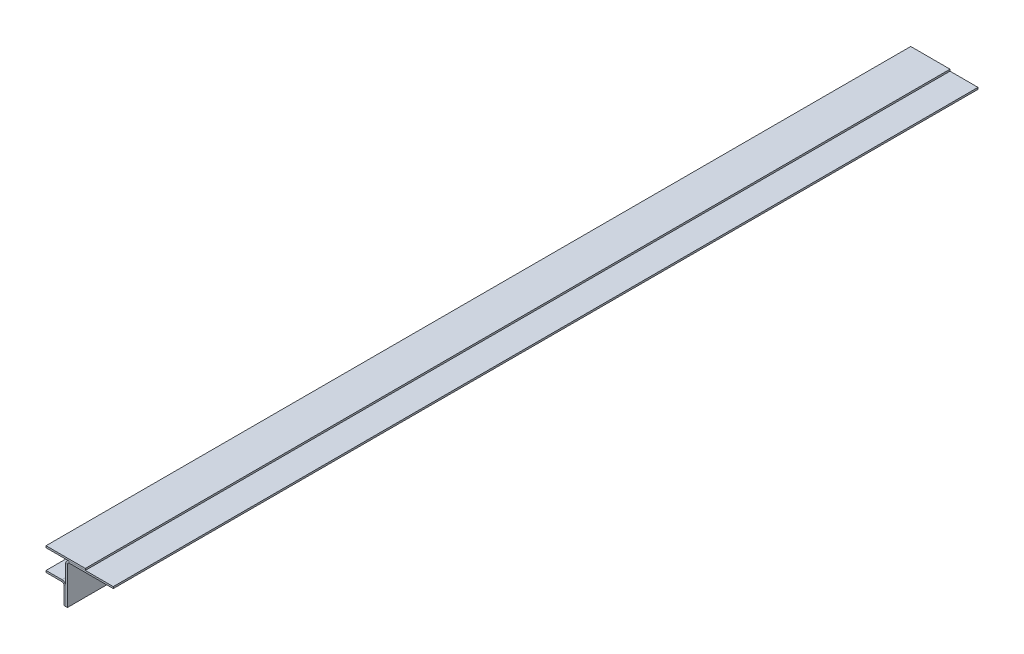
ISO-10303-21;
HEADER;
FILE_DESCRIPTION(('STEP AP214'),'2;1');
FILE_NAME('part.step','',(''),(''),'','','');
FILE_SCHEMA(('AUTOMOTIVE_DESIGN { 1 0 10303 214 1 1 1 1 }'));
ENDSEC;
DATA;
#1=APPLICATION_CONTEXT('core data for automotive mechanical design processes');
#2=APPLICATION_PROTOCOL_DEFINITION('international standard','automotive_design',2000,#1);
#3=PRODUCT_CONTEXT('',#1,'mechanical');
#4=PRODUCT('Part','Part','',(#3));
#5=PRODUCT_RELATED_PRODUCT_CATEGORY('part','',(#4));
#6=PRODUCT_DEFINITION_FORMATION('','',#4);
#7=PRODUCT_DEFINITION_CONTEXT('part definition',#1,'design');
#8=PRODUCT_DEFINITION('design','',#6,#7);
#9=PRODUCT_DEFINITION_SHAPE('','',#8);
#10=(LENGTH_UNIT() NAMED_UNIT(*) SI_UNIT(.MILLI.,.METRE.));
#11=(NAMED_UNIT(*) PLANE_ANGLE_UNIT() SI_UNIT($,.RADIAN.));
#12=(NAMED_UNIT(*) SI_UNIT($,.STERADIAN.) SOLID_ANGLE_UNIT());
#13=UNCERTAINTY_MEASURE_WITH_UNIT(LENGTH_MEASURE(1.E-05),#10,'distance_accuracy_value','');
#14=(GEOMETRIC_REPRESENTATION_CONTEXT(3) GLOBAL_UNCERTAINTY_ASSIGNED_CONTEXT((#13)) GLOBAL_UNIT_ASSIGNED_CONTEXT((#10,
#11,#12)) REPRESENTATION_CONTEXT('',''));
#15=CARTESIAN_POINT('',(0.,0.,0.));
#16=DIRECTION('',(0.,0.,1.));
#17=DIRECTION('',(1.,0.,0.));
#18=AXIS2_PLACEMENT_3D('',#15,#16,#17);
#19=CARTESIAN_POINT('',(34.671,83.058,-1676.4));
#20=DIRECTION('',(0.,1.,0.));
#21=DIRECTION('',(0.,0.,1.));
#22=AXIS2_PLACEMENT_3D('',#19,#20,#21);
#23=PLANE('',#22);
#24=DIRECTION('',(1.,0.,0.));
#25=VECTOR('',#24,1.);
#26=CARTESIAN_POINT('',(34.671,83.058,0.));
#27=LINE('',#26,#25);
#28=CARTESIAN_POINT('',(34.671,83.058,0.));
#29=VERTEX_POINT('',#28);
#30=CARTESIAN_POINT('',(-41.529,83.058,0.));
#31=VERTEX_POINT('',#30);
#32=EDGE_CURVE('E117',#29,#31,#27,.F.);
#33=ORIENTED_EDGE('',*,*,#32,.F.);
#34=DIRECTION('',(0.,0.,1.));
#35=VECTOR('',#34,1.);
#36=CARTESIAN_POINT('',(34.671,83.058,-1676.4));
#37=LINE('',#36,#35);
#38=CARTESIAN_POINT('',(34.671,83.058,-1676.4));
#39=VERTEX_POINT('',#38);
#40=EDGE_CURVE('E12',#39,#29,#37,.T.);
#41=ORIENTED_EDGE('',*,*,#40,.F.);
#42=DIRECTION('',(1.,0.,0.));
#43=VECTOR('',#42,1.);
#44=CARTESIAN_POINT('',(34.671,83.058,-1676.4));
#45=LINE('',#44,#43);
#46=CARTESIAN_POINT('',(-41.529,83.058,-1676.4));
#47=VERTEX_POINT('',#46);
#48=EDGE_CURVE('E112',#39,#47,#45,.F.);
#49=ORIENTED_EDGE('',*,*,#48,.T.);
#50=DIRECTION('',(0.,0.,1.));
#51=VECTOR('',#50,1.);
#52=CARTESIAN_POINT('',(-41.529,83.058,-1676.4));
#53=LINE('',#52,#51);
#54=EDGE_CURVE('E55',#47,#31,#53,.T.);
#55=ORIENTED_EDGE('',*,*,#54,.T.);
#56=EDGE_LOOP('',(#33,#41,#49,#55));
#57=FACE_BOUND('',#56,.T.);
#58=ADVANCED_FACE('F52',(#57),#23,.T.);
#59=CARTESIAN_POINT('',(34.671,83.058,-1676.4));
#60=DIRECTION('',(-1.,0.,0.));
#61=DIRECTION('',(0.,0.,1.));
#62=AXIS2_PLACEMENT_3D('',#59,#60,#61);
#63=PLANE('',#62);
#64=DIRECTION('',(0.,-1.,0.));
#65=VECTOR('',#64,1.);
#66=CARTESIAN_POINT('',(34.671,83.058,0.));
#67=LINE('',#66,#65);
#68=CARTESIAN_POINT('',(34.671,79.629,0.));
#69=VERTEX_POINT('',#68);
#70=EDGE_CURVE('E85',#29,#69,#67,.T.);
#71=ORIENTED_EDGE('',*,*,#70,.T.);
#72=DIRECTION('',(0.,0.,1.));
#73=VECTOR('',#72,1.);
#74=CARTESIAN_POINT('',(34.671,79.629,-1676.4));
#75=LINE('',#74,#73);
#76=CARTESIAN_POINT('',(34.671,79.629,-1676.4));
#77=VERTEX_POINT('',#76);
#78=EDGE_CURVE('E61',#77,#69,#75,.T.);
#79=ORIENTED_EDGE('',*,*,#78,.F.);
#80=DIRECTION('',(0.,-1.,0.));
#81=VECTOR('',#80,1.);
#82=CARTESIAN_POINT('',(34.671,83.058,-1676.4));
#83=LINE('',#82,#81);
#84=EDGE_CURVE('E100',#39,#77,#83,.T.);
#85=ORIENTED_EDGE('',*,*,#84,.F.);
#86=ORIENTED_EDGE('',*,*,#40,.T.);
#87=EDGE_LOOP('',(#71,#79,#85,#86));
#88=FACE_BOUND('',#87,.T.);
#89=ADVANCED_FACE('F127',(#88),#63,.F.);
#90=CARTESIAN_POINT('',(34.671,79.629,-1676.4));
#91=DIRECTION('',(0.,1.,0.));
#92=DIRECTION('',(0.,0.,1.));
#93=AXIS2_PLACEMENT_3D('',#90,#91,#92);
#94=PLANE('',#93);
#95=DIRECTION('',(-1.,0.,0.));
#96=VECTOR('',#95,1.);
#97=CARTESIAN_POINT('',(34.671,79.629,0.));
#98=LINE('',#97,#96);
#99=CARTESIAN_POINT('',(-41.529,79.629,0.));
#100=VERTEX_POINT('',#99);
#101=EDGE_CURVE('E107',#69,#100,#98,.T.);
#102=ORIENTED_EDGE('',*,*,#101,.T.);
#103=DIRECTION('',(0.,0.,1.));
#104=VECTOR('',#103,1.);
#105=CARTESIAN_POINT('',(-41.529,79.629,-1676.4));
#106=LINE('',#105,#104);
#107=CARTESIAN_POINT('',(-41.529,79.629,-1676.4));
#108=VERTEX_POINT('',#107);
#109=EDGE_CURVE('E104',#108,#100,#106,.T.);
#110=ORIENTED_EDGE('',*,*,#109,.F.);
#111=DIRECTION('',(-1.,0.,0.));
#112=VECTOR('',#111,1.);
#113=CARTESIAN_POINT('',(34.671,79.629,-1676.4));
#114=LINE('',#113,#112);
#115=EDGE_CURVE('E97',#77,#108,#114,.T.);
#116=ORIENTED_EDGE('',*,*,#115,.F.);
#117=ORIENTED_EDGE('',*,*,#78,.T.);
#118=EDGE_LOOP('',(#102,#110,#116,#117));
#119=FACE_BOUND('',#118,.T.);
#120=ADVANCED_FACE('F105',(#119),#94,.F.);
#121=CARTESIAN_POINT('',(-41.529,79.629,-1676.4));
#122=DIRECTION('',(1.,0.,0.));
#123=DIRECTION('',(0.,0.,-1.));
#124=AXIS2_PLACEMENT_3D('',#121,#122,#123);
#125=PLANE('',#124);
#126=DIRECTION('',(0.,1.,0.));
#127=VECTOR('',#126,1.);
#128=CARTESIAN_POINT('',(-41.529,79.629,0.));
#129=LINE('',#128,#127);
#130=EDGE_CURVE('E120',#100,#31,#129,.T.);
#131=ORIENTED_EDGE('',*,*,#130,.T.);
#132=ORIENTED_EDGE('',*,*,#54,.F.);
#133=DIRECTION('',(0.,1.,0.));
#134=VECTOR('',#133,1.);
#135=CARTESIAN_POINT('',(-41.529,79.629,-1676.4));
#136=LINE('',#135,#134);
#137=EDGE_CURVE('E94',#108,#47,#136,.T.);
#138=ORIENTED_EDGE('',*,*,#137,.F.);
#139=ORIENTED_EDGE('',*,*,#109,.T.);
#140=EDGE_LOOP('',(#131,#132,#138,#139));
#141=FACE_BOUND('',#140,.T.);
#142=ADVANCED_FACE('F111',(#141),#125,.F.);
#143=CARTESIAN_POINT('',(0.,0.,-1676.4));
#144=DIRECTION('',(0.,0.,1.));
#145=DIRECTION('',(1.,0.,0.));
#146=AXIS2_PLACEMENT_3D('',#143,#144,#145);
#147=PLANE('',#146);
#148=ORIENTED_EDGE('',*,*,#48,.F.);
#149=ORIENTED_EDGE('',*,*,#84,.T.);
#150=ORIENTED_EDGE('',*,*,#115,.T.);
#151=ORIENTED_EDGE('',*,*,#137,.T.);
#152=EDGE_LOOP('',(#148,#149,#150,#151));
#153=FACE_BOUND('',#152,.T.);
#154=ADVANCED_FACE('F99',(#153),#147,.F.);
#155=CARTESIAN_POINT('',(0.,0.,0.));
#156=DIRECTION('',(0.,0.,1.));
#157=DIRECTION('',(1.,0.,0.));
#158=AXIS2_PLACEMENT_3D('',#155,#156,#157);
#159=PLANE('',#158);
#160=ORIENTED_EDGE('',*,*,#32,.T.);
#161=ORIENTED_EDGE('',*,*,#130,.F.);
#162=ORIENTED_EDGE('',*,*,#101,.F.);
#163=ORIENTED_EDGE('',*,*,#70,.F.);
#164=EDGE_LOOP('',(#160,#161,#162,#163));
#165=FACE_BOUND('',#164,.T.);
#166=ADVANCED_FACE('F125',(#165),#159,.T.);
#167=CLOSED_SHELL('',(#58,#89,#120,#142,#154,#166));
#168=MANIFOLD_SOLID_BREP('B2',#167);
#169=CARTESIAN_POINT('',(-10.4394,41.529,-1676.4));
#170=DIRECTION('',(0.,0.,-1.));
#171=DIRECTION('',(-1.,0.,0.));
#172=AXIS2_PLACEMENT_3D('',#169,#170,#171);
#173=PLANE('',#172);
#174=DIRECTION('',(0.,-1.,0.));
#175=VECTOR('',#174,1.);
#176=CARTESIAN_POINT('',(-10.4394,41.529,-1676.4));
#177=LINE('',#176,#175);
#178=CARTESIAN_POINT('',(-10.4394,41.529,-1676.4));
#179=VERTEX_POINT('',#178);
#180=CARTESIAN_POINT('',(-10.4394,38.1,-1676.4));
#181=VERTEX_POINT('',#180);
#182=EDGE_CURVE('E50',#179,#181,#177,.T.);
#183=ORIENTED_EDGE('',*,*,#182,.F.);
#184=CARTESIAN_POINT('',(-10.4394,34.5186,-1676.4));
#185=DIRECTION('',(0.,0.,1.));
#186=DIRECTION('',(1.,0.,0.));
#187=AXIS2_PLACEMENT_3D('',#184,#185,#186);
#188=CIRCLE('',#187,7.0104);
#189=CARTESIAN_POINT('',(-3.429,34.5186,-1676.4));
#190=VERTEX_POINT('',#189);
#191=EDGE_CURVE('E353',#179,#190,#188,.F.);
#192=ORIENTED_EDGE('',*,*,#191,.T.);
#193=DIRECTION('',(1.,0.,0.));
#194=VECTOR('',#193,1.);
#195=CARTESIAN_POINT('',(-6.858,34.5186,-1676.4));
#196=LINE('',#195,#194);
#197=CARTESIAN_POINT('',(-6.858,34.5186,-1676.4));
#198=VERTEX_POINT('',#197);
#199=EDGE_CURVE('E217',#198,#190,#196,.T.);
#200=ORIENTED_EDGE('',*,*,#199,.F.);
#201=CARTESIAN_POINT('',(-10.4394,34.5186,-1676.4));
#202=DIRECTION('',(0.,0.,1.));
#203=DIRECTION('',(1.,0.,0.));
#204=AXIS2_PLACEMENT_3D('',#201,#202,#203);
#205=CIRCLE('',#204,3.5814);
#206=EDGE_CURVE('E306',#181,#198,#205,.F.);
#207=ORIENTED_EDGE('',*,*,#206,.F.);
#208=EDGE_LOOP('',(#183,#192,#200,#207));
#209=FACE_BOUND('',#208,.T.);
#210=ADVANCED_FACE('F209',(#209),#173,.T.);
#211=CARTESIAN_POINT('',(-6.858,34.5186,-1676.4));
#212=DIRECTION('',(0.,0.,-1.));
#213=DIRECTION('',(-1.,0.,0.));
#214=AXIS2_PLACEMENT_3D('',#211,#212,#213);
#215=PLANE('',#214);
#216=DIRECTION('',(1.,0.,0.));
#217=VECTOR('',#216,1.);
#218=CARTESIAN_POINT('',(-41.529,41.529,-1676.4));
#219=LINE('',#218,#217);
#220=CARTESIAN_POINT('',(-41.529,41.529,-1676.4));
#221=VERTEX_POINT('',#220);
#222=EDGE_CURVE('E302',#221,#179,#219,.T.);
#223=ORIENTED_EDGE('',*,*,#222,.T.);
#224=ORIENTED_EDGE('',*,*,#182,.T.);
#225=DIRECTION('',(1.,0.,0.));
#226=VECTOR('',#225,1.);
#227=CARTESIAN_POINT('',(-41.529,38.1,-1676.4));
#228=LINE('',#227,#226);
#229=CARTESIAN_POINT('',(-41.529,38.1,-1676.4));
#230=VERTEX_POINT('',#229);
#231=EDGE_CURVE('E287',#230,#181,#228,.T.);
#232=ORIENTED_EDGE('',*,*,#231,.F.);
#233=DIRECTION('',(0.,1.,0.));
#234=VECTOR('',#233,1.);
#235=CARTESIAN_POINT('',(-41.529,38.1,-1676.4));
#236=LINE('',#235,#234);
#237=EDGE_CURVE('E296',#230,#221,#236,.T.);
#238=ORIENTED_EDGE('',*,*,#237,.T.);
#239=EDGE_LOOP('',(#223,#224,#232,#238));
#240=FACE_BOUND('',#239,.T.);
#241=ADVANCED_FACE('F304',(#240),#215,.T.);
#242=CARTESIAN_POINT('',(-3.429,34.5186,0.));
#243=DIRECTION('',(0.,0.,1.));
#244=DIRECTION('',(1.,0.,0.));
#245=AXIS2_PLACEMENT_3D('',#242,#243,#244);
#246=PLANE('',#245);
#247=DIRECTION('',(-1.,0.,0.));
#248=VECTOR('',#247,1.);
#249=CARTESIAN_POINT('',(-3.429,34.5186,0.));
#250=LINE('',#249,#248);
#251=CARTESIAN_POINT('',(-3.429,34.5186,0.));
#252=VERTEX_POINT('',#251);
#253=CARTESIAN_POINT('',(-6.858,34.5186,0.));
#254=VERTEX_POINT('',#253);
#255=EDGE_CURVE('E259',#252,#254,#250,.T.);
#256=ORIENTED_EDGE('',*,*,#255,.F.);
#257=CARTESIAN_POINT('',(-10.4394,34.5186,0.));
#258=DIRECTION('',(0.,0.,1.));
#259=DIRECTION('',(1.,0.,0.));
#260=AXIS2_PLACEMENT_3D('',#257,#258,#259);
#261=CIRCLE('',#260,7.0104);
#262=CARTESIAN_POINT('',(-10.4394,41.529,0.));
#263=VERTEX_POINT('',#262);
#264=EDGE_CURVE('E320',#263,#252,#261,.F.);
#265=ORIENTED_EDGE('',*,*,#264,.F.);
#266=DIRECTION('',(0.,1.,0.));
#267=VECTOR('',#266,1.);
#268=CARTESIAN_POINT('',(-10.4394,38.1,0.));
#269=LINE('',#268,#267);
#270=CARTESIAN_POINT('',(-10.4394,38.1,0.));
#271=VERTEX_POINT('',#270);
#272=EDGE_CURVE('E252',#271,#263,#269,.T.);
#273=ORIENTED_EDGE('',*,*,#272,.F.);
#274=CARTESIAN_POINT('',(-10.4394,34.5186,0.));
#275=DIRECTION('',(0.,0.,1.));
#276=DIRECTION('',(1.,0.,0.));
#277=AXIS2_PLACEMENT_3D('',#274,#275,#276);
#278=CIRCLE('',#277,3.5814);
#279=EDGE_CURVE('E329',#271,#254,#278,.F.);
#280=ORIENTED_EDGE('',*,*,#279,.T.);
#281=EDGE_LOOP('',(#256,#265,#273,#280));
#282=FACE_BOUND('',#281,.T.);
#283=ADVANCED_FACE('F367',(#282),#246,.T.);
#284=CARTESIAN_POINT('',(-10.4394,38.1,0.));
#285=DIRECTION('',(0.,0.,1.));
#286=DIRECTION('',(1.,0.,0.));
#287=AXIS2_PLACEMENT_3D('',#284,#285,#286);
#288=PLANE('',#287);
#289=DIRECTION('',(0.,-1.,0.));
#290=VECTOR('',#289,1.);
#291=CARTESIAN_POINT('',(-3.429,41.529,0.));
#292=LINE('',#291,#290);
#293=CARTESIAN_POINT('',(-3.429,0.,0.));
#294=VERTEX_POINT('',#293);
#295=EDGE_CURVE('E318',#252,#294,#292,.T.);
#296=ORIENTED_EDGE('',*,*,#295,.F.);
#297=ORIENTED_EDGE('',*,*,#255,.T.);
#298=DIRECTION('',(0.,-1.,0.));
#299=VECTOR('',#298,1.);
#300=CARTESIAN_POINT('',(-6.858,41.529,0.));
#301=LINE('',#300,#299);
#302=CARTESIAN_POINT('',(-6.858,0.,0.));
#303=VERTEX_POINT('',#302);
#304=EDGE_CURVE('E313',#254,#303,#301,.T.);
#305=ORIENTED_EDGE('',*,*,#304,.T.);
#306=DIRECTION('',(-1.,0.,0.));
#307=VECTOR('',#306,1.);
#308=CARTESIAN_POINT('',(-3.429,0.,0.));
#309=LINE('',#308,#307);
#310=EDGE_CURVE('E315',#294,#303,#309,.T.);
#311=ORIENTED_EDGE('',*,*,#310,.F.);
#312=EDGE_LOOP('',(#296,#297,#305,#311));
#313=FACE_BOUND('',#312,.T.);
#314=ADVANCED_FACE('F375',(#313),#288,.T.);
#315=CARTESIAN_POINT('',(-6.858,41.529,-1676.4));
#316=DIRECTION('',(-1.,0.,0.));
#317=DIRECTION('',(0.,-1.,0.));
#318=AXIS2_PLACEMENT_3D('',#315,#316,#317);
#319=PLANE('',#318);
#320=ORIENTED_EDGE('',*,*,#304,.F.);
#321=DIRECTION('',(0.,0.,1.));
#322=VECTOR('',#321,1.);
#323=CARTESIAN_POINT('',(-6.858,34.5186,-1676.4));
#324=LINE('',#323,#322);
#325=EDGE_CURVE('E332',#198,#254,#324,.T.);
#326=ORIENTED_EDGE('',*,*,#325,.F.);
#327=DIRECTION('',(0.,-1.,0.));
#328=VECTOR('',#327,1.);
#329=CARTESIAN_POINT('',(-6.858,41.529,-1676.4));
#330=LINE('',#329,#328);
#331=CARTESIAN_POINT('',(-6.858,0.,-1676.4));
#332=VERTEX_POINT('',#331);
#333=EDGE_CURVE('E331',#198,#332,#330,.T.);
#334=ORIENTED_EDGE('',*,*,#333,.T.);
#335=DIRECTION('',(0.,0.,1.));
#336=VECTOR('',#335,1.);
#337=CARTESIAN_POINT('',(-6.858,0.,-1676.4));
#338=LINE('',#337,#336);
#339=EDGE_CURVE('E309',#332,#303,#338,.T.);
#340=ORIENTED_EDGE('',*,*,#339,.T.);
#341=EDGE_LOOP('',(#320,#326,#334,#340));
#342=FACE_BOUND('',#341,.T.);
#343=ADVANCED_FACE('F373',(#342),#319,.T.);
#344=CARTESIAN_POINT('',(-10.4394,34.5186,-1676.4));
#345=DIRECTION('',(0.,0.,1.));
#346=DIRECTION('',(1.,0.,0.));
#347=AXIS2_PLACEMENT_3D('',#344,#345,#346);
#348=CYLINDRICAL_SURFACE('',#347,3.5814);
#349=ORIENTED_EDGE('',*,*,#279,.F.);
#350=DIRECTION('',(0.,0.,1.));
#351=VECTOR('',#350,1.);
#352=CARTESIAN_POINT('',(-10.4394,38.1,-1676.4));
#353=LINE('',#352,#351);
#354=EDGE_CURVE('E292',#181,#271,#353,.T.);
#355=ORIENTED_EDGE('',*,*,#354,.F.);
#356=ORIENTED_EDGE('',*,*,#206,.T.);
#357=ORIENTED_EDGE('',*,*,#325,.T.);
#358=EDGE_LOOP('',(#349,#355,#356,#357));
#359=FACE_BOUND('',#358,.T.);
#360=ADVANCED_FACE('F370',(#359),#348,.F.);
#361=CARTESIAN_POINT('',(-41.529,38.1,-1676.4));
#362=DIRECTION('',(0.,-1.,0.));
#363=DIRECTION('',(1.,0.,0.));
#364=AXIS2_PLACEMENT_3D('',#361,#362,#363);
#365=PLANE('',#364);
#366=DIRECTION('',(1.,0.,0.));
#367=VECTOR('',#366,1.);
#368=CARTESIAN_POINT('',(-41.529,38.1,0.));
#369=LINE('',#368,#367);
#370=CARTESIAN_POINT('',(-41.529,38.1,0.));
#371=VERTEX_POINT('',#370);
#372=EDGE_CURVE('E289',#371,#271,#369,.T.);
#373=ORIENTED_EDGE('',*,*,#372,.F.);
#374=DIRECTION('',(0.,0.,1.));
#375=VECTOR('',#374,1.);
#376=CARTESIAN_POINT('',(-41.529,38.1,-1676.4));
#377=LINE('',#376,#375);
#378=EDGE_CURVE('E283',#230,#371,#377,.T.);
#379=ORIENTED_EDGE('',*,*,#378,.F.);
#380=ORIENTED_EDGE('',*,*,#231,.T.);
#381=ORIENTED_EDGE('',*,*,#354,.T.);
#382=EDGE_LOOP('',(#373,#379,#380,#381));
#383=FACE_BOUND('',#382,.T.);
#384=ADVANCED_FACE('F285',(#383),#365,.T.);
#385=CARTESIAN_POINT('',(-41.529,38.1,-1676.4));
#386=DIRECTION('',(1.,0.,0.));
#387=DIRECTION('',(0.,0.,-1.));
#388=AXIS2_PLACEMENT_3D('',#385,#386,#387);
#389=PLANE('',#388);
#390=DIRECTION('',(0.,1.,0.));
#391=VECTOR('',#390,1.);
#392=CARTESIAN_POINT('',(-41.529,38.1,0.));
#393=LINE('',#392,#391);
#394=CARTESIAN_POINT('',(-41.529,41.529,0.));
#395=VERTEX_POINT('',#394);
#396=EDGE_CURVE('E326',#371,#395,#393,.T.);
#397=ORIENTED_EDGE('',*,*,#396,.T.);
#398=DIRECTION('',(0.,0.,1.));
#399=VECTOR('',#398,1.);
#400=CARTESIAN_POINT('',(-41.529,41.529,-1676.4));
#401=LINE('',#400,#399);
#402=EDGE_CURVE('E293',#221,#395,#401,.T.);
#403=ORIENTED_EDGE('',*,*,#402,.F.);
#404=ORIENTED_EDGE('',*,*,#237,.F.);
#405=ORIENTED_EDGE('',*,*,#378,.T.);
#406=EDGE_LOOP('',(#397,#403,#404,#405));
#407=FACE_BOUND('',#406,.T.);
#408=ADVANCED_FACE('F297',(#407),#389,.F.);
#409=CARTESIAN_POINT('',(-41.529,41.529,-1676.4));
#410=DIRECTION('',(0.,-1.,0.));
#411=DIRECTION('',(1.,0.,0.));
#412=AXIS2_PLACEMENT_3D('',#409,#410,#411);
#413=PLANE('',#412);
#414=DIRECTION('',(1.,0.,0.));
#415=VECTOR('',#414,1.);
#416=CARTESIAN_POINT('',(-41.529,41.529,0.));
#417=LINE('',#416,#415);
#418=EDGE_CURVE('E323',#395,#263,#417,.T.);
#419=ORIENTED_EDGE('',*,*,#418,.T.);
#420=DIRECTION('',(0.,0.,1.));
#421=VECTOR('',#420,1.);
#422=CARTESIAN_POINT('',(-10.4394,41.529,-1676.4));
#423=LINE('',#422,#421);
#424=EDGE_CURVE('E336',#179,#263,#423,.T.);
#425=ORIENTED_EDGE('',*,*,#424,.F.);
#426=ORIENTED_EDGE('',*,*,#222,.F.);
#427=ORIENTED_EDGE('',*,*,#402,.T.);
#428=EDGE_LOOP('',(#419,#425,#426,#427));
#429=FACE_BOUND('',#428,.T.);
#430=ADVANCED_FACE('F365',(#429),#413,.F.);
#431=CARTESIAN_POINT('',(-10.4394,34.5186,-1676.4));
#432=DIRECTION('',(0.,0.,1.));
#433=DIRECTION('',(1.,0.,0.));
#434=AXIS2_PLACEMENT_3D('',#431,#432,#433);
#435=CYLINDRICAL_SURFACE('',#434,7.0104);
#436=ORIENTED_EDGE('',*,*,#264,.T.);
#437=DIRECTION('',(0.,0.,1.));
#438=VECTOR('',#437,1.);
#439=CARTESIAN_POINT('',(-3.429,34.5186,-1676.4));
#440=LINE('',#439,#438);
#441=EDGE_CURVE('E339',#190,#252,#440,.T.);
#442=ORIENTED_EDGE('',*,*,#441,.F.);
#443=ORIENTED_EDGE('',*,*,#191,.F.);
#444=ORIENTED_EDGE('',*,*,#424,.T.);
#445=EDGE_LOOP('',(#436,#442,#443,#444));
#446=FACE_BOUND('',#445,.T.);
#447=ADVANCED_FACE('F357',(#446),#435,.T.);
#448=CARTESIAN_POINT('',(-3.429,41.529,-1676.4));
#449=DIRECTION('',(-1.,0.,0.));
#450=DIRECTION('',(0.,-1.,0.));
#451=AXIS2_PLACEMENT_3D('',#448,#449,#450);
#452=PLANE('',#451);
#453=ORIENTED_EDGE('',*,*,#295,.T.);
#454=DIRECTION('',(0.,0.,1.));
#455=VECTOR('',#454,1.);
#456=CARTESIAN_POINT('',(-3.429,0.,-1676.4));
#457=LINE('',#456,#455);
#458=CARTESIAN_POINT('',(-3.429,0.,-1676.4));
#459=VERTEX_POINT('',#458);
#460=EDGE_CURVE('E342',#459,#294,#457,.T.);
#461=ORIENTED_EDGE('',*,*,#460,.F.);
#462=DIRECTION('',(0.,-1.,0.));
#463=VECTOR('',#462,1.);
#464=CARTESIAN_POINT('',(-3.429,41.529,-1676.4));
#465=LINE('',#464,#463);
#466=EDGE_CURVE('E349',#190,#459,#465,.T.);
#467=ORIENTED_EDGE('',*,*,#466,.F.);
#468=ORIENTED_EDGE('',*,*,#441,.T.);
#469=EDGE_LOOP('',(#453,#461,#467,#468));
#470=FACE_BOUND('',#469,.T.);
#471=ADVANCED_FACE('F359',(#470),#452,.F.);
#472=CARTESIAN_POINT('',(-3.429,0.,-1676.4));
#473=DIRECTION('',(0.,1.,0.));
#474=DIRECTION('',(0.,0.,1.));
#475=AXIS2_PLACEMENT_3D('',#472,#473,#474);
#476=PLANE('',#475);
#477=ORIENTED_EDGE('',*,*,#310,.T.);
#478=ORIENTED_EDGE('',*,*,#339,.F.);
#479=DIRECTION('',(-1.,0.,0.));
#480=VECTOR('',#479,1.);
#481=CARTESIAN_POINT('',(-3.429,0.,-1676.4));
#482=LINE('',#481,#480);
#483=EDGE_CURVE('E268',#459,#332,#482,.T.);
#484=ORIENTED_EDGE('',*,*,#483,.F.);
#485=ORIENTED_EDGE('',*,*,#460,.T.);
#486=EDGE_LOOP('',(#477,#478,#484,#485));
#487=FACE_BOUND('',#486,.T.);
#488=ADVANCED_FACE('F377',(#487),#476,.F.);
#489=CARTESIAN_POINT('',(-10.4394,34.5186,-1676.4));
#490=DIRECTION('',(0.,0.,1.));
#491=DIRECTION('',(1.,0.,0.));
#492=AXIS2_PLACEMENT_3D('',#489,#490,#491);
#493=PLANE('',#492);
#494=ORIENTED_EDGE('',*,*,#333,.F.);
#495=ORIENTED_EDGE('',*,*,#199,.T.);
#496=ORIENTED_EDGE('',*,*,#466,.T.);
#497=ORIENTED_EDGE('',*,*,#483,.T.);
#498=EDGE_LOOP('',(#494,#495,#496,#497));
#499=FACE_BOUND('',#498,.T.);
#500=ADVANCED_FACE('F347',(#499),#493,.F.);
#501=CARTESIAN_POINT('',(-10.4394,34.5186,0.));
#502=DIRECTION('',(0.,0.,1.));
#503=DIRECTION('',(1.,0.,0.));
#504=AXIS2_PLACEMENT_3D('',#501,#502,#503);
#505=PLANE('',#504);
#506=ORIENTED_EDGE('',*,*,#372,.T.);
#507=ORIENTED_EDGE('',*,*,#272,.T.);
#508=ORIENTED_EDGE('',*,*,#418,.F.);
#509=ORIENTED_EDGE('',*,*,#396,.F.);
#510=EDGE_LOOP('',(#506,#507,#508,#509));
#511=FACE_BOUND('',#510,.T.);
#512=ADVANCED_FACE('F384',(#511),#505,.T.);
#513=CLOSED_SHELL('',(#210,#241,#283,#314,#343,#360,#384,#408,#430,#447,#471,#488,#500,#512));
#514=MANIFOLD_SOLID_BREP('B6',#513);
#515=CARTESIAN_POINT('',(3.5814,76.2,-1676.4));
#516=DIRECTION('',(0.,0.,-1.));
#517=DIRECTION('',(-1.,0.,0.));
#518=AXIS2_PLACEMENT_3D('',#515,#516,#517);
#519=PLANE('',#518);
#520=DIRECTION('',(0.,1.,0.));
#521=VECTOR('',#520,1.);
#522=CARTESIAN_POINT('',(3.5814,76.2,-1676.4));
#523=LINE('',#522,#521);
#524=CARTESIAN_POINT('',(3.5814,76.2,-1676.4));
#525=VERTEX_POINT('',#524);
#526=CARTESIAN_POINT('',(3.5814,79.629,-1676.4));
#527=VERTEX_POINT('',#526);
#528=EDGE_CURVE('E207',#525,#527,#523,.T.);
#529=ORIENTED_EDGE('',*,*,#528,.F.);
#530=CARTESIAN_POINT('',(3.5814,72.6186,-1676.4));
#531=DIRECTION('',(0.,0.,1.));
#532=DIRECTION('',(1.,0.,0.));
#533=AXIS2_PLACEMENT_3D('',#530,#531,#532);
#534=CIRCLE('',#533,3.5814);
#535=CARTESIAN_POINT('',(0.,72.6185999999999,-1676.4));
#536=VERTEX_POINT('',#535);
#537=EDGE_CURVE('E646',#536,#525,#534,.F.);
#538=ORIENTED_EDGE('',*,*,#537,.F.);
#539=DIRECTION('',(1.,0.,0.));
#540=VECTOR('',#539,1.);
#541=CARTESIAN_POINT('',(-3.429,72.6185999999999,-1676.4));
#542=LINE('',#541,#540);
#543=CARTESIAN_POINT('',(-3.429,72.6185999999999,-1676.4));
#544=VERTEX_POINT('',#543);
#545=EDGE_CURVE('E557',#544,#536,#542,.T.);
#546=ORIENTED_EDGE('',*,*,#545,.F.);
#547=CARTESIAN_POINT('',(3.5814,72.6186,-1676.4));
#548=DIRECTION('',(0.,0.,1.));
#549=DIRECTION('',(1.,0.,0.));
#550=AXIS2_PLACEMENT_3D('',#547,#548,#549);
#551=CIRCLE('',#550,7.0104);
#552=EDGE_CURVE('E698',#544,#527,#551,.F.);
#553=ORIENTED_EDGE('',*,*,#552,.T.);
#554=EDGE_LOOP('',(#529,#538,#546,#553));
#555=FACE_BOUND('',#554,.T.);
#556=ADVANCED_FACE('F549',(#555),#519,.T.);
#557=CARTESIAN_POINT('',(-3.429,72.6185999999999,-1676.4));
#558=DIRECTION('',(0.,0.,-1.));
#559=DIRECTION('',(-1.,0.,0.));
#560=AXIS2_PLACEMENT_3D('',#557,#558,#559);
#561=PLANE('',#560);
#562=DIRECTION('',(1.,0.,0.));
#563=VECTOR('',#562,1.);
#564=CARTESIAN_POINT('',(0.,76.2,-1676.4));
#565=LINE('',#564,#563);
#566=CARTESIAN_POINT('',(88.9,76.2,-1676.4));
#567=VERTEX_POINT('',#566);
#568=EDGE_CURVE('E671',#525,#567,#565,.T.);
#569=ORIENTED_EDGE('',*,*,#568,.F.);
#570=ORIENTED_EDGE('',*,*,#528,.T.);
#571=DIRECTION('',(1.,0.,0.));
#572=VECTOR('',#571,1.);
#573=CARTESIAN_POINT('',(0.,79.629,-1676.4));
#574=LINE('',#573,#572);
#575=CARTESIAN_POINT('',(88.9,79.629,-1676.4));
#576=VERTEX_POINT('',#575);
#577=EDGE_CURVE('E714',#527,#576,#574,.T.);
#578=ORIENTED_EDGE('',*,*,#577,.T.);
#579=DIRECTION('',(0.,-1.,0.));
#580=VECTOR('',#579,1.);
#581=CARTESIAN_POINT('',(88.9,79.629,-1676.4));
#582=LINE('',#581,#580);
#583=EDGE_CURVE('E608',#576,#567,#582,.T.);
#584=ORIENTED_EDGE('',*,*,#583,.T.);
#585=EDGE_LOOP('',(#569,#570,#578,#584));
#586=FACE_BOUND('',#585,.T.);
#587=ADVANCED_FACE('F719',(#586),#561,.T.);
#588=CARTESIAN_POINT('',(0.,72.6185999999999,0.));
#589=DIRECTION('',(0.,0.,1.));
#590=DIRECTION('',(1.,0.,0.));
#591=AXIS2_PLACEMENT_3D('',#588,#589,#590);
#592=PLANE('',#591);
#593=DIRECTION('',(-1.,0.,0.));
#594=VECTOR('',#593,1.);
#595=CARTESIAN_POINT('',(0.,72.6185999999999,0.));
#596=LINE('',#595,#594);
#597=CARTESIAN_POINT('',(0.,72.6185999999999,0.));
#598=VERTEX_POINT('',#597);
#599=CARTESIAN_POINT('',(-3.429,72.6185999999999,0.));
#600=VERTEX_POINT('',#599);
#601=EDGE_CURVE('E592',#598,#600,#596,.T.);
#602=ORIENTED_EDGE('',*,*,#601,.F.);
#603=CARTESIAN_POINT('',(3.5814,72.6186,0.));
#604=DIRECTION('',(0.,0.,1.));
#605=DIRECTION('',(1.,0.,0.));
#606=AXIS2_PLACEMENT_3D('',#603,#604,#605);
#607=CIRCLE('',#606,3.5814);
#608=CARTESIAN_POINT('',(3.5814,76.2,0.));
#609=VERTEX_POINT('',#608);
#610=EDGE_CURVE('E669',#598,#609,#607,.F.);
#611=ORIENTED_EDGE('',*,*,#610,.T.);
#612=DIRECTION('',(0.,-1.,0.));
#613=VECTOR('',#612,1.);
#614=CARTESIAN_POINT('',(3.5814,79.629,0.));
#615=LINE('',#614,#613);
#616=CARTESIAN_POINT('',(3.5814,79.629,0.));
#617=VERTEX_POINT('',#616);
#618=EDGE_CURVE('E599',#617,#609,#615,.T.);
#619=ORIENTED_EDGE('',*,*,#618,.F.);
#620=CARTESIAN_POINT('',(3.5814,72.6186,0.));
#621=DIRECTION('',(0.,0.,1.));
#622=DIRECTION('',(1.,0.,0.));
#623=AXIS2_PLACEMENT_3D('',#620,#621,#622);
#624=CIRCLE('',#623,7.0104);
#625=EDGE_CURVE('E660',#600,#617,#624,.F.);
#626=ORIENTED_EDGE('',*,*,#625,.F.);
#627=EDGE_LOOP('',(#602,#611,#619,#626));
#628=FACE_BOUND('',#627,.T.);
#629=ADVANCED_FACE('F699',(#628),#592,.T.);
#630=CARTESIAN_POINT('',(3.5814,79.629,0.));
#631=DIRECTION('',(0.,0.,1.));
#632=DIRECTION('',(1.,0.,0.));
#633=AXIS2_PLACEMENT_3D('',#630,#631,#632);
#634=PLANE('',#633);
#635=DIRECTION('',(0.,1.,0.));
#636=VECTOR('',#635,1.);
#637=CARTESIAN_POINT('',(0.,0.,0.));
#638=LINE('',#637,#636);
#639=CARTESIAN_POINT('',(0.,0.,0.));
#640=VERTEX_POINT('',#639);
#641=EDGE_CURVE('E629',#640,#598,#638,.T.);
#642=ORIENTED_EDGE('',*,*,#641,.T.);
#643=ORIENTED_EDGE('',*,*,#601,.T.);
#644=DIRECTION('',(0.,1.,0.));
#645=VECTOR('',#644,1.);
#646=CARTESIAN_POINT('',(-3.429,0.,0.));
#647=LINE('',#646,#645);
#648=CARTESIAN_POINT('',(-3.429,0.,0.));
#649=VERTEX_POINT('',#648);
#650=EDGE_CURVE('E663',#649,#600,#647,.T.);
#651=ORIENTED_EDGE('',*,*,#650,.F.);
#652=DIRECTION('',(-1.,0.,0.));
#653=VECTOR('',#652,1.);
#654=CARTESIAN_POINT('',(0.,0.,0.));
#655=LINE('',#654,#653);
#656=EDGE_CURVE('E666',#640,#649,#655,.T.);
#657=ORIENTED_EDGE('',*,*,#656,.F.);
#658=EDGE_LOOP('',(#642,#643,#651,#657));
#659=FACE_BOUND('',#658,.T.);
#660=ADVANCED_FACE('F689',(#659),#634,.T.);
#661=CARTESIAN_POINT('',(0.,76.2,-1676.4));
#662=DIRECTION('',(0.,-1.,0.));
#663=DIRECTION('',(0.,0.,-1.));
#664=AXIS2_PLACEMENT_3D('',#661,#662,#663);
#665=PLANE('',#664);
#666=DIRECTION('',(1.,0.,0.));
#667=VECTOR('',#666,1.);
#668=CARTESIAN_POINT('',(0.,76.2,0.));
#669=LINE('',#668,#667);
#670=CARTESIAN_POINT('',(88.9,76.2,0.));
#671=VERTEX_POINT('',#670);
#672=EDGE_CURVE('E653',#609,#671,#669,.T.);
#673=ORIENTED_EDGE('',*,*,#672,.F.);
#674=DIRECTION('',(0.,0.,1.));
#675=VECTOR('',#674,1.);
#676=CARTESIAN_POINT('',(3.5814,76.2,-1676.4));
#677=LINE('',#676,#675);
#678=EDGE_CURVE('E672',#525,#609,#677,.T.);
#679=ORIENTED_EDGE('',*,*,#678,.F.);
#680=ORIENTED_EDGE('',*,*,#568,.T.);
#681=DIRECTION('',(0.,0.,1.));
#682=VECTOR('',#681,1.);
#683=CARTESIAN_POINT('',(88.9,76.2,-1676.4));
#684=LINE('',#683,#682);
#685=EDGE_CURVE('E649',#567,#671,#684,.T.);
#686=ORIENTED_EDGE('',*,*,#685,.T.);
#687=EDGE_LOOP('',(#673,#679,#680,#686));
#688=FACE_BOUND('',#687,.T.);
#689=ADVANCED_FACE('F705',(#688),#665,.T.);
#690=CARTESIAN_POINT('',(3.5814,72.6186,-1676.4));
#691=DIRECTION('',(0.,0.,1.));
#692=DIRECTION('',(1.,0.,0.));
#693=AXIS2_PLACEMENT_3D('',#690,#691,#692);
#694=CYLINDRICAL_SURFACE('',#693,3.5814);
#695=ORIENTED_EDGE('',*,*,#610,.F.);
#696=DIRECTION('',(0.,0.,1.));
#697=VECTOR('',#696,1.);
#698=CARTESIAN_POINT('',(0.,72.6185999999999,-1676.4));
#699=LINE('',#698,#697);
#700=EDGE_CURVE('E632',#536,#598,#699,.T.);
#701=ORIENTED_EDGE('',*,*,#700,.F.);
#702=ORIENTED_EDGE('',*,*,#537,.T.);
#703=ORIENTED_EDGE('',*,*,#678,.T.);
#704=EDGE_LOOP('',(#695,#701,#702,#703));
#705=FACE_BOUND('',#704,.T.);
#706=ADVANCED_FACE('F701',(#705),#694,.F.);
#707=CARTESIAN_POINT('',(0.,0.,-1676.4));
#708=DIRECTION('',(1.,0.,0.));
#709=DIRECTION('',(0.,0.,-1.));
#710=AXIS2_PLACEMENT_3D('',#707,#708,#709);
#711=PLANE('',#710);
#712=ORIENTED_EDGE('',*,*,#641,.F.);
#713=DIRECTION('',(0.,0.,1.));
#714=VECTOR('',#713,1.);
#715=CARTESIAN_POINT('',(0.,0.,-1676.4));
#716=LINE('',#715,#714);
#717=CARTESIAN_POINT('',(0.,0.,-1676.4));
#718=VERTEX_POINT('',#717);
#719=EDGE_CURVE('E623',#718,#640,#716,.T.);
#720=ORIENTED_EDGE('',*,*,#719,.F.);
#721=DIRECTION('',(0.,1.,0.));
#722=VECTOR('',#721,1.);
#723=CARTESIAN_POINT('',(0.,0.,-1676.4));
#724=LINE('',#723,#722);
#725=EDGE_CURVE('E627',#718,#536,#724,.T.);
#726=ORIENTED_EDGE('',*,*,#725,.T.);
#727=ORIENTED_EDGE('',*,*,#700,.T.);
#728=EDGE_LOOP('',(#712,#720,#726,#727));
#729=FACE_BOUND('',#728,.T.);
#730=ADVANCED_FACE('F625',(#729),#711,.T.);
#731=CARTESIAN_POINT('',(0.,0.,-1676.4));
#732=DIRECTION('',(0.,1.,0.));
#733=DIRECTION('',(0.,0.,1.));
#734=AXIS2_PLACEMENT_3D('',#731,#732,#733);
#735=PLANE('',#734);
#736=ORIENTED_EDGE('',*,*,#656,.T.);
#737=DIRECTION('',(0.,0.,1.));
#738=VECTOR('',#737,1.);
#739=CARTESIAN_POINT('',(-3.429,0.,-1676.4));
#740=LINE('',#739,#738);
#741=CARTESIAN_POINT('',(-3.429,0.,-1676.4));
#742=VERTEX_POINT('',#741);
#743=EDGE_CURVE('E633',#742,#649,#740,.T.);
#744=ORIENTED_EDGE('',*,*,#743,.F.);
#745=DIRECTION('',(-1.,0.,0.));
#746=VECTOR('',#745,1.);
#747=CARTESIAN_POINT('',(0.,0.,-1676.4));
#748=LINE('',#747,#746);
#749=EDGE_CURVE('E636',#718,#742,#748,.T.);
#750=ORIENTED_EDGE('',*,*,#749,.F.);
#751=ORIENTED_EDGE('',*,*,#719,.T.);
#752=EDGE_LOOP('',(#736,#744,#750,#751));
#753=FACE_BOUND('',#752,.T.);
#754=ADVANCED_FACE('F637',(#753),#735,.F.);
#755=CARTESIAN_POINT('',(-3.429,0.,-1676.4));
#756=DIRECTION('',(1.,0.,0.));
#757=DIRECTION('',(0.,0.,-1.));
#758=AXIS2_PLACEMENT_3D('',#755,#756,#757);
#759=PLANE('',#758);
#760=ORIENTED_EDGE('',*,*,#650,.T.);
#761=DIRECTION('',(0.,0.,1.));
#762=VECTOR('',#761,1.);
#763=CARTESIAN_POINT('',(-3.429,72.6185999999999,-1676.4));
#764=LINE('',#763,#762);
#765=EDGE_CURVE('E676',#544,#600,#764,.T.);
#766=ORIENTED_EDGE('',*,*,#765,.F.);
#767=DIRECTION('',(0.,1.,0.));
#768=VECTOR('',#767,1.);
#769=CARTESIAN_POINT('',(-3.429,0.,-1676.4));
#770=LINE('',#769,#768);
#771=EDGE_CURVE('E642',#742,#544,#770,.T.);
#772=ORIENTED_EDGE('',*,*,#771,.F.);
#773=ORIENTED_EDGE('',*,*,#743,.T.);
#774=EDGE_LOOP('',(#760,#766,#772,#773));
#775=FACE_BOUND('',#774,.T.);
#776=ADVANCED_FACE('F693',(#775),#759,.F.);
#777=CARTESIAN_POINT('',(3.5814,72.6186,-1676.4));
#778=DIRECTION('',(0.,0.,1.));
#779=DIRECTION('',(1.,0.,0.));
#780=AXIS2_PLACEMENT_3D('',#777,#778,#779);
#781=CYLINDRICAL_SURFACE('',#780,7.0104);
#782=ORIENTED_EDGE('',*,*,#625,.T.);
#783=DIRECTION('',(0.,0.,1.));
#784=VECTOR('',#783,1.);
#785=CARTESIAN_POINT('',(3.5814,79.629,-1676.4));
#786=LINE('',#785,#784);
#787=EDGE_CURVE('E679',#527,#617,#786,.T.);
#788=ORIENTED_EDGE('',*,*,#787,.F.);
#789=ORIENTED_EDGE('',*,*,#552,.F.);
#790=ORIENTED_EDGE('',*,*,#765,.T.);
#791=EDGE_LOOP('',(#782,#788,#789,#790));
#792=FACE_BOUND('',#791,.T.);
#793=ADVANCED_FACE('F696',(#792),#781,.T.);
#794=CARTESIAN_POINT('',(0.,79.629,-1676.4));
#795=DIRECTION('',(0.,-1.,0.));
#796=DIRECTION('',(0.,0.,-1.));
#797=AXIS2_PLACEMENT_3D('',#794,#795,#796);
#798=PLANE('',#797);
#799=DIRECTION('',(1.,0.,0.));
#800=VECTOR('',#799,1.);
#801=CARTESIAN_POINT('',(0.,79.629,0.));
#802=LINE('',#801,#800);
#803=CARTESIAN_POINT('',(88.9,79.629,0.));
#804=VERTEX_POINT('',#803);
#805=EDGE_CURVE('E658',#617,#804,#802,.T.);
#806=ORIENTED_EDGE('',*,*,#805,.T.);
#807=DIRECTION('',(0.,0.,1.));
#808=VECTOR('',#807,1.);
#809=CARTESIAN_POINT('',(88.9,79.629,-1676.4));
#810=LINE('',#809,#808);
#811=EDGE_CURVE('E682',#576,#804,#810,.T.);
#812=ORIENTED_EDGE('',*,*,#811,.F.);
#813=ORIENTED_EDGE('',*,*,#577,.F.);
#814=ORIENTED_EDGE('',*,*,#787,.T.);
#815=EDGE_LOOP('',(#806,#812,#813,#814));
#816=FACE_BOUND('',#815,.T.);
#817=ADVANCED_FACE('F713',(#816),#798,.F.);
#818=CARTESIAN_POINT('',(88.9,79.629,-1676.4));
#819=DIRECTION('',(-1.,0.,0.));
#820=DIRECTION('',(0.,0.,1.));
#821=AXIS2_PLACEMENT_3D('',#818,#819,#820);
#822=PLANE('',#821);
#823=DIRECTION('',(0.,-1.,0.));
#824=VECTOR('',#823,1.);
#825=CARTESIAN_POINT('',(88.9,79.629,0.));
#826=LINE('',#825,#824);
#827=EDGE_CURVE('E655',#804,#671,#826,.T.);
#828=ORIENTED_EDGE('',*,*,#827,.T.);
#829=ORIENTED_EDGE('',*,*,#685,.F.);
#830=ORIENTED_EDGE('',*,*,#583,.F.);
#831=ORIENTED_EDGE('',*,*,#811,.T.);
#832=EDGE_LOOP('',(#828,#829,#830,#831));
#833=FACE_BOUND('',#832,.T.);
#834=ADVANCED_FACE('F709',(#833),#822,.F.);
#835=CARTESIAN_POINT('',(3.5814,72.6186,-1676.4));
#836=DIRECTION('',(0.,0.,1.));
#837=DIRECTION('',(1.,0.,0.));
#838=AXIS2_PLACEMENT_3D('',#835,#836,#837);
#839=PLANE('',#838);
#840=ORIENTED_EDGE('',*,*,#771,.T.);
#841=ORIENTED_EDGE('',*,*,#545,.T.);
#842=ORIENTED_EDGE('',*,*,#725,.F.);
#843=ORIENTED_EDGE('',*,*,#749,.T.);
#844=EDGE_LOOP('',(#840,#841,#842,#843));
#845=FACE_BOUND('',#844,.T.);
#846=ADVANCED_FACE('F644',(#845),#839,.F.);
#847=CARTESIAN_POINT('',(3.5814,72.6186,0.));
#848=DIRECTION('',(0.,0.,1.));
#849=DIRECTION('',(1.,0.,0.));
#850=AXIS2_PLACEMENT_3D('',#847,#848,#849);
#851=PLANE('',#850);
#852=ORIENTED_EDGE('',*,*,#672,.T.);
#853=ORIENTED_EDGE('',*,*,#827,.F.);
#854=ORIENTED_EDGE('',*,*,#805,.F.);
#855=ORIENTED_EDGE('',*,*,#618,.T.);
#856=EDGE_LOOP('',(#852,#853,#854,#855));
#857=FACE_BOUND('',#856,.T.);
#858=ADVANCED_FACE('F707',(#857),#851,.T.);
#859=CLOSED_SHELL('',(#556,#587,#629,#660,#689,#706,#730,#754,#776,#793,#817,#834,#846,#858));
#860=MANIFOLD_SOLID_BREP('B44',#859);
#861=ADVANCED_BREP_SHAPE_REPRESENTATION('',(#18,#168,#514,#860),#14);
#862=SHAPE_DEFINITION_REPRESENTATION(#9,#861);
ENDSEC;
END-ISO-10303-21;
